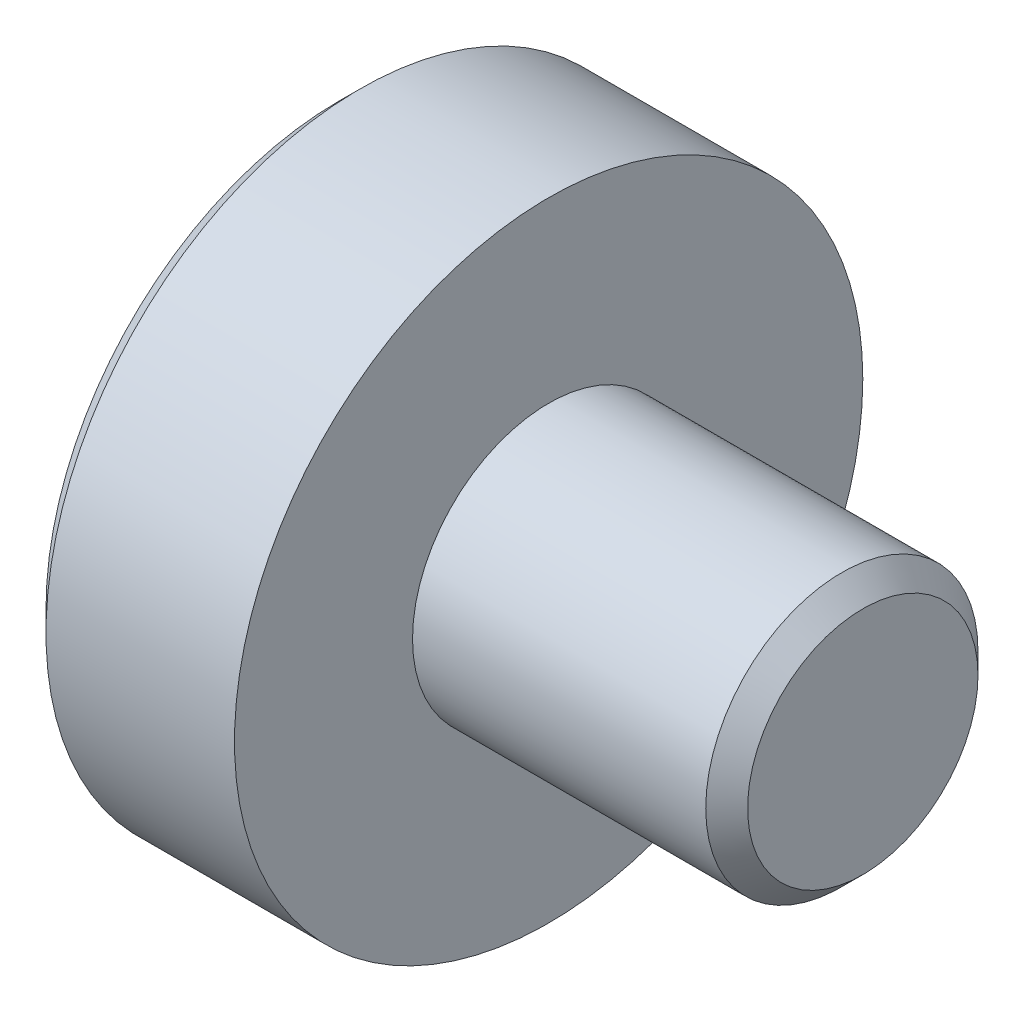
from build123d import *

# Parameters (mm, degrees)
SKETCH1_R           = 15
BOSS_EXTRUDE1_DEPTH = 10
SKETCH2_R           = 6.5
BOSS_EXTRUDE2_DEPTH = 15
CHAMFER1_SIZE       = 1


with BuildPart() as part:
    # Sketch1 → Boss-Extrude1 (new body)
    with BuildSketch(Plane(origin=(0, 0, 0), x_dir=(0, 0, -1), z_dir=(1, 0, 0))):
        Circle(SKETCH1_R)
    extrude(amount=BOSS_EXTRUDE1_DEPTH)

    # Sketch2 → Boss-Extrude2 (add)
    with BuildSketch(Plane(origin=(10, 0, 0), x_dir=(0, 0, -1), z_dir=(1, 0, 0))):
        Circle(SKETCH2_R)
    extrude(amount=BOSS_EXTRUDE2_DEPTH)

    # Chamfer1
    chamfer1_edges = [part.edges().sort_by_distance(p)[0] for p in [
        (0, 0, 15),
        (25, 0, 6.5),
    ]]
    chamfer(chamfer1_edges, length=CHAMFER1_SIZE)


solid = part.part
